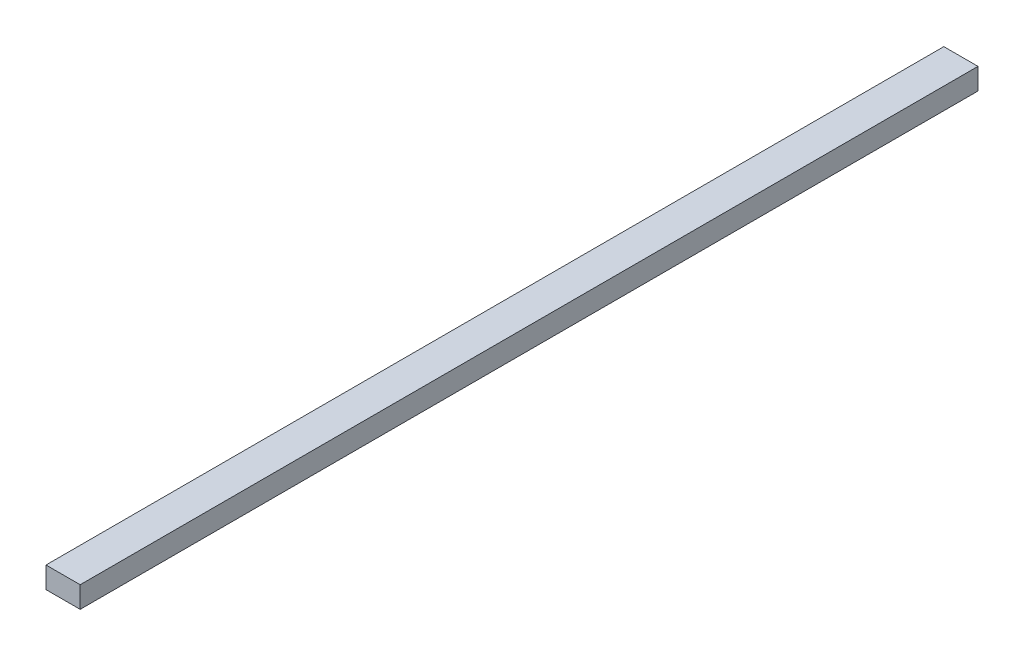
from build123d import *

# Parameters (mm, degrees)
SKETCH1_W           = 25.4
SKETCH1_H           = 15.875
BOSS_EXTRUDE1_DEPTH = 667.40024


with BuildPart() as part:
    # Sketch1 → Boss-Extrude1 (new body)
    with BuildSketch(Plane.XY):
        with Locations((-28.379601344, 4.576815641)):
            Rectangle(SKETCH1_W, SKETCH1_H)
    extrude(amount=BOSS_EXTRUDE1_DEPTH)


solid = part.part
